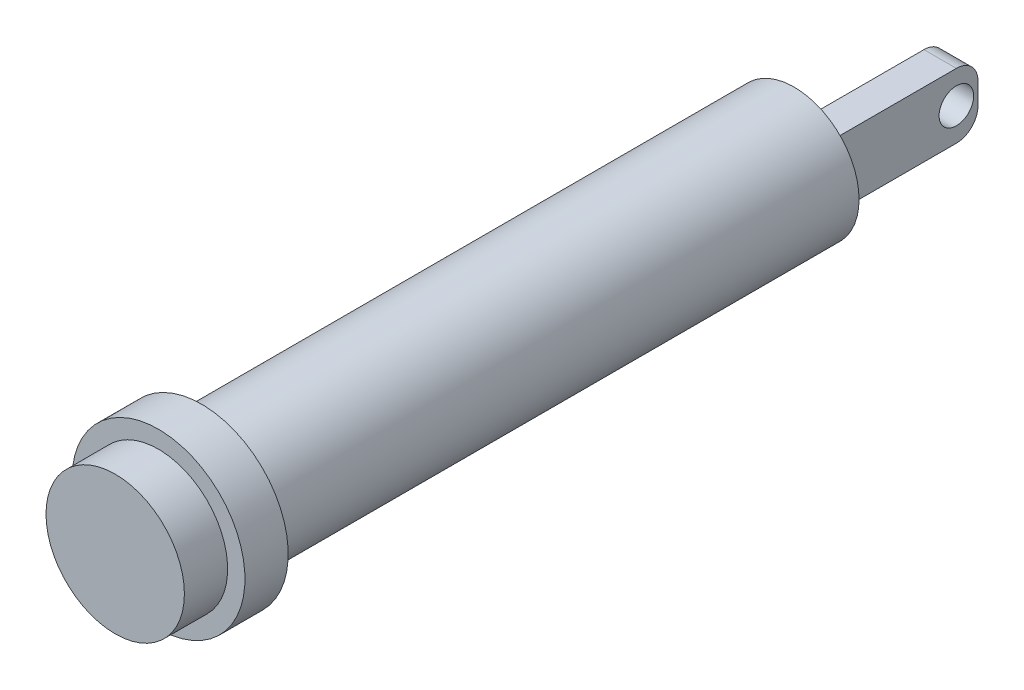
ISO-10303-21;
HEADER;
FILE_DESCRIPTION(('STEP AP214'),'2;1');
FILE_NAME('part.step','',(''),(''),'','','');
FILE_SCHEMA(('AUTOMOTIVE_DESIGN { 1 0 10303 214 1 1 1 1 }'));
ENDSEC;
DATA;
#1=APPLICATION_CONTEXT('core data for automotive mechanical design processes');
#2=APPLICATION_PROTOCOL_DEFINITION('international standard','automotive_design',2000,#1);
#3=PRODUCT_CONTEXT('',#1,'mechanical');
#4=PRODUCT('Part','Part','',(#3));
#5=PRODUCT_RELATED_PRODUCT_CATEGORY('part','',(#4));
#6=PRODUCT_DEFINITION_FORMATION('','',#4);
#7=PRODUCT_DEFINITION_CONTEXT('part definition',#1,'design');
#8=PRODUCT_DEFINITION('design','',#6,#7);
#9=PRODUCT_DEFINITION_SHAPE('','',#8);
#10=(LENGTH_UNIT() NAMED_UNIT(*) SI_UNIT(.MILLI.,.METRE.));
#11=(NAMED_UNIT(*) PLANE_ANGLE_UNIT() SI_UNIT($,.RADIAN.));
#12=(NAMED_UNIT(*) SI_UNIT($,.STERADIAN.) SOLID_ANGLE_UNIT());
#13=UNCERTAINTY_MEASURE_WITH_UNIT(LENGTH_MEASURE(1.E-05),#10,'distance_accuracy_value','');
#14=(GEOMETRIC_REPRESENTATION_CONTEXT(3) GLOBAL_UNCERTAINTY_ASSIGNED_CONTEXT((#13)) GLOBAL_UNIT_ASSIGNED_CONTEXT((#10,
#11,#12)) REPRESENTATION_CONTEXT('',''));
#15=CARTESIAN_POINT('',(0.,0.,0.));
#16=DIRECTION('',(0.,0.,1.));
#17=DIRECTION('',(1.,0.,0.));
#18=AXIS2_PLACEMENT_3D('',#15,#16,#17);
#19=CARTESIAN_POINT('',(0.,0.,-500.));
#20=DIRECTION('',(0.,0.,1.));
#21=DIRECTION('',(1.,0.,0.));
#22=AXIS2_PLACEMENT_3D('',#19,#20,#21);
#23=PLANE('',#22);
#24=DIRECTION('',(1.,0.,0.));
#25=VECTOR('',#24,1.);
#26=CARTESIAN_POINT('',(37.5,37.5000000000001,-500.));
#27=LINE('',#26,#25);
#28=CARTESIAN_POINT('',(0.,37.5000000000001,-500.));
#29=VERTEX_POINT('',#28);
#30=CARTESIAN_POINT('',(37.5,37.5000000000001,-500.));
#31=VERTEX_POINT('',#30);
#32=EDGE_CURVE('E109',#29,#31,#27,.T.);
#33=ORIENTED_EDGE('',*,*,#32,.F.);
#34=DIRECTION('',(0.,-1.,0.));
#35=VECTOR('',#34,1.);
#36=CARTESIAN_POINT('',(0.,37.5000000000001,-500.));
#37=LINE('',#36,#35);
#38=CARTESIAN_POINT('',(0.,-37.4999999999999,-500.));
#39=VERTEX_POINT('',#38);
#40=EDGE_CURVE('E93',#29,#39,#37,.T.);
#41=ORIENTED_EDGE('',*,*,#40,.T.);
#42=DIRECTION('',(-1.,0.,0.));
#43=VECTOR('',#42,1.);
#44=CARTESIAN_POINT('',(37.5,-37.4999999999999,-500.));
#45=LINE('',#44,#43);
#46=CARTESIAN_POINT('',(37.5,-37.4999999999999,-500.));
#47=VERTEX_POINT('',#46);
#48=EDGE_CURVE('E117',#47,#39,#45,.T.);
#49=ORIENTED_EDGE('',*,*,#48,.F.);
#50=DIRECTION('',(0.,-1.,0.));
#51=VECTOR('',#50,1.);
#52=CARTESIAN_POINT('',(37.5,-37.4999999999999,-500.));
#53=LINE('',#52,#51);
#54=EDGE_CURVE('E115',#31,#47,#53,.T.);
#55=ORIENTED_EDGE('',*,*,#54,.F.);
#56=EDGE_LOOP('',(#33,#41,#49,#55));
#57=FACE_BOUND('',#56,.T.);
#58=CARTESIAN_POINT('',(0.,0.,-500.));
#59=DIRECTION('',(0.,0.,1.));
#60=DIRECTION('',(1.,0.,0.));
#61=AXIS2_PLACEMENT_3D('',#58,#59,#60);
#62=CIRCLE('',#61,75.0000000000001);
#63=CARTESIAN_POINT('',(75.0000000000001,0.,-500.));
#64=VERTEX_POINT('',#63);
#65=EDGE_CURVE('E128',#64,#64,#62,.T.);
#66=ORIENTED_EDGE('',*,*,#65,.F.);
#67=EDGE_LOOP('',(#66));
#68=FACE_BOUND('',#67,.T.);
#69=ADVANCED_FACE('F38',(#57,#68),#23,.F.);
#70=CARTESIAN_POINT('',(0.,0.,0.));
#71=DIRECTION('',(0.,0.,1.));
#72=DIRECTION('',(1.,0.,0.));
#73=AXIS2_PLACEMENT_3D('',#70,#71,#72);
#74=CYLINDRICAL_SURFACE('',#73,75.);
#75=CARTESIAN_POINT('',(0.,0.,185.));
#76=DIRECTION('',(0.,0.,-1.));
#77=DIRECTION('',(-1.,0.,0.));
#78=AXIS2_PLACEMENT_3D('',#75,#76,#77);
#79=CIRCLE('',#78,75.);
#80=CARTESIAN_POINT('',(-75.,0.,185.));
#81=VERTEX_POINT('',#80);
#82=EDGE_CURVE('E42',#81,#81,#79,.T.);
#83=ORIENTED_EDGE('',*,*,#82,.T.);
#84=EDGE_LOOP('',(#83));
#85=FACE_BOUND('',#84,.T.);
#86=ORIENTED_EDGE('',*,*,#65,.T.);
#87=EDGE_LOOP('',(#86));
#88=FACE_BOUND('',#87,.T.);
#89=ADVANCED_FACE('F191',(#85,#88),#74,.T.);
#90=CARTESIAN_POINT('',(37.5,37.5000000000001,-675.));
#91=DIRECTION('',(0.,-1.,0.));
#92=DIRECTION('',(0.,0.,-1.));
#93=AXIS2_PLACEMENT_3D('',#90,#91,#92);
#94=PLANE('',#93);
#95=DIRECTION('',(0.,0.,1.));
#96=VECTOR('',#95,1.);
#97=CARTESIAN_POINT('',(37.5,37.5000000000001,-675.));
#98=LINE('',#97,#96);
#99=CARTESIAN_POINT('',(37.5,37.5000000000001,-650.));
#100=VERTEX_POINT('',#99);
#101=EDGE_CURVE('E126',#100,#31,#98,.T.);
#102=ORIENTED_EDGE('',*,*,#101,.F.);
#103=DIRECTION('',(1.,0.,0.));
#104=VECTOR('',#103,1.);
#105=CARTESIAN_POINT('',(37.5,37.5000000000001,-650.));
#106=LINE('',#105,#104);
#107=CARTESIAN_POINT('',(0.,37.5000000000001,-650.));
#108=VERTEX_POINT('',#107);
#109=EDGE_CURVE('E11',#100,#108,#106,.F.);
#110=ORIENTED_EDGE('',*,*,#109,.T.);
#111=DIRECTION('',(0.,0.,-1.));
#112=VECTOR('',#111,1.);
#113=CARTESIAN_POINT('',(0.,37.5000000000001,-500.));
#114=LINE('',#113,#112);
#115=EDGE_CURVE('E97',#29,#108,#114,.T.);
#116=ORIENTED_EDGE('',*,*,#115,.F.);
#117=ORIENTED_EDGE('',*,*,#32,.T.);
#118=EDGE_LOOP('',(#102,#110,#116,#117));
#119=FACE_BOUND('',#118,.T.);
#120=ADVANCED_FACE('F108',(#119),#94,.F.);
#121=CARTESIAN_POINT('',(37.5,-37.4999999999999,-675.));
#122=DIRECTION('',(-1.,0.,0.));
#123=DIRECTION('',(0.,0.,1.));
#124=AXIS2_PLACEMENT_3D('',#121,#122,#123);
#125=PLANE('',#124);
#126=CARTESIAN_POINT('',(37.5,0.,-650.));
#127=DIRECTION('',(1.,0.,0.));
#128=DIRECTION('',(0.,0.,-1.));
#129=AXIS2_PLACEMENT_3D('',#126,#127,#128);
#130=CIRCLE('',#129,20.);
#131=CARTESIAN_POINT('',(37.5,0.,-670.));
#132=VERTEX_POINT('',#131);
#133=EDGE_CURVE('E145',#132,#132,#130,.T.);
#134=ORIENTED_EDGE('',*,*,#133,.F.);
#135=EDGE_LOOP('',(#134));
#136=FACE_BOUND('',#135,.T.);
#137=DIRECTION('',(0.,0.,1.));
#138=VECTOR('',#137,1.);
#139=CARTESIAN_POINT('',(37.5,-37.4999999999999,-675.));
#140=LINE('',#139,#138);
#141=CARTESIAN_POINT('',(37.5,-37.4999999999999,-650.));
#142=VERTEX_POINT('',#141);
#143=EDGE_CURVE('E124',#142,#47,#140,.T.);
#144=ORIENTED_EDGE('',*,*,#143,.F.);
#145=CARTESIAN_POINT('',(37.5,-12.4999999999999,-650.));
#146=DIRECTION('',(-1.,0.,0.));
#147=DIRECTION('',(0.,0.,1.));
#148=AXIS2_PLACEMENT_3D('',#145,#146,#147);
#149=CIRCLE('',#148,25.);
#150=CARTESIAN_POINT('',(37.5,-12.4999999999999,-675.));
#151=VERTEX_POINT('',#150);
#152=EDGE_CURVE('E47',#142,#151,#149,.F.);
#153=ORIENTED_EDGE('',*,*,#152,.T.);
#154=DIRECTION('',(0.,-1.,0.));
#155=VECTOR('',#154,1.);
#156=CARTESIAN_POINT('',(37.5,-37.4999999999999,-675.));
#157=LINE('',#156,#155);
#158=CARTESIAN_POINT('',(37.5,12.5000000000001,-675.));
#159=VERTEX_POINT('',#158);
#160=EDGE_CURVE('E121',#159,#151,#157,.T.);
#161=ORIENTED_EDGE('',*,*,#160,.F.);
#162=CARTESIAN_POINT('',(37.5,12.5000000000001,-650.));
#163=DIRECTION('',(-1.,0.,0.));
#164=DIRECTION('',(0.,0.,1.));
#165=AXIS2_PLACEMENT_3D('',#162,#163,#164);
#166=CIRCLE('',#165,25.);
#167=EDGE_CURVE('E55',#159,#100,#166,.F.);
#168=ORIENTED_EDGE('',*,*,#167,.T.);
#169=ORIENTED_EDGE('',*,*,#101,.T.);
#170=ORIENTED_EDGE('',*,*,#54,.T.);
#171=EDGE_LOOP('',(#144,#153,#161,#168,#169,#170));
#172=FACE_BOUND('',#171,.T.);
#173=ADVANCED_FACE('F212',(#136,#172),#125,.F.);
#174=CARTESIAN_POINT('',(37.5,-37.4999999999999,-675.));
#175=DIRECTION('',(0.,1.,0.));
#176=DIRECTION('',(0.,0.,1.));
#177=AXIS2_PLACEMENT_3D('',#174,#175,#176);
#178=PLANE('',#177);
#179=DIRECTION('',(0.,0.,-1.));
#180=VECTOR('',#179,1.);
#181=CARTESIAN_POINT('',(0.,-37.4999999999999,-500.));
#182=LINE('',#181,#180);
#183=CARTESIAN_POINT('',(0.,-37.4999999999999,-650.));
#184=VERTEX_POINT('',#183);
#185=EDGE_CURVE('E99',#39,#184,#182,.T.);
#186=ORIENTED_EDGE('',*,*,#185,.T.);
#187=DIRECTION('',(-1.,0.,0.));
#188=VECTOR('',#187,1.);
#189=CARTESIAN_POINT('',(37.5,-37.4999999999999,-650.));
#190=LINE('',#189,#188);
#191=EDGE_CURVE('E63',#184,#142,#190,.F.);
#192=ORIENTED_EDGE('',*,*,#191,.T.);
#193=ORIENTED_EDGE('',*,*,#143,.T.);
#194=ORIENTED_EDGE('',*,*,#48,.T.);
#195=EDGE_LOOP('',(#186,#192,#193,#194));
#196=FACE_BOUND('',#195,.T.);
#197=ADVANCED_FACE('F216',(#196),#178,.F.);
#198=CARTESIAN_POINT('',(0.,0.,-675.));
#199=DIRECTION('',(0.,0.,1.));
#200=DIRECTION('',(1.,0.,0.));
#201=AXIS2_PLACEMENT_3D('',#198,#199,#200);
#202=PLANE('',#201);
#203=ORIENTED_EDGE('',*,*,#160,.T.);
#204=DIRECTION('',(-1.,0.,0.));
#205=VECTOR('',#204,1.);
#206=CARTESIAN_POINT('',(0.,-12.4999999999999,-675.));
#207=LINE('',#206,#205);
#208=CARTESIAN_POINT('',(0.,-12.4999999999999,-675.));
#209=VERTEX_POINT('',#208);
#210=EDGE_CURVE('E134',#151,#209,#207,.T.);
#211=ORIENTED_EDGE('',*,*,#210,.T.);
#212=DIRECTION('',(0.,-1.,0.));
#213=VECTOR('',#212,1.);
#214=CARTESIAN_POINT('',(0.,37.5000000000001,-675.));
#215=LINE('',#214,#213);
#216=CARTESIAN_POINT('',(0.,12.5000000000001,-675.));
#217=VERTEX_POINT('',#216);
#218=EDGE_CURVE('E104',#217,#209,#215,.T.);
#219=ORIENTED_EDGE('',*,*,#218,.F.);
#220=DIRECTION('',(1.,0.,0.));
#221=VECTOR('',#220,1.);
#222=CARTESIAN_POINT('',(0.,12.5000000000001,-675.));
#223=LINE('',#222,#221);
#224=EDGE_CURVE('E131',#217,#159,#223,.T.);
#225=ORIENTED_EDGE('',*,*,#224,.T.);
#226=EDGE_LOOP('',(#203,#211,#219,#225));
#227=FACE_BOUND('',#226,.T.);
#228=ADVANCED_FACE('F207',(#227),#202,.F.);
#229=CARTESIAN_POINT('',(0.,37.5000000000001,-500.));
#230=DIRECTION('',(1.,0.,0.));
#231=DIRECTION('',(0.,0.,-1.));
#232=AXIS2_PLACEMENT_3D('',#229,#230,#231);
#233=PLANE('',#232);
#234=CARTESIAN_POINT('',(0.,0.,-650.));
#235=DIRECTION('',(1.,0.,0.));
#236=DIRECTION('',(0.,0.,-1.));
#237=AXIS2_PLACEMENT_3D('',#234,#235,#236);
#238=CIRCLE('',#237,20.);
#239=CARTESIAN_POINT('',(0.,0.,-670.));
#240=VERTEX_POINT('',#239);
#241=EDGE_CURVE('E143',#240,#240,#238,.T.);
#242=ORIENTED_EDGE('',*,*,#241,.T.);
#243=EDGE_LOOP('',(#242));
#244=FACE_BOUND('',#243,.T.);
#245=ORIENTED_EDGE('',*,*,#218,.T.);
#246=CARTESIAN_POINT('',(0.,-12.4999999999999,-650.));
#247=DIRECTION('',(1.,0.,0.));
#248=DIRECTION('',(0.,0.,-1.));
#249=AXIS2_PLACEMENT_3D('',#246,#247,#248);
#250=CIRCLE('',#249,25.);
#251=EDGE_CURVE('E139',#209,#184,#250,.F.);
#252=ORIENTED_EDGE('',*,*,#251,.T.);
#253=ORIENTED_EDGE('',*,*,#185,.F.);
#254=ORIENTED_EDGE('',*,*,#40,.F.);
#255=ORIENTED_EDGE('',*,*,#115,.T.);
#256=CARTESIAN_POINT('',(0.,12.5000000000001,-650.));
#257=DIRECTION('',(1.,0.,0.));
#258=DIRECTION('',(0.,0.,-1.));
#259=AXIS2_PLACEMENT_3D('',#256,#257,#258);
#260=CIRCLE('',#259,25.);
#261=EDGE_CURVE('E137',#108,#217,#260,.F.);
#262=ORIENTED_EDGE('',*,*,#261,.T.);
#263=EDGE_LOOP('',(#245,#252,#253,#254,#255,#262));
#264=FACE_BOUND('',#263,.T.);
#265=ADVANCED_FACE('F96',(#244,#264),#233,.F.);
#266=CARTESIAN_POINT('',(0.,-12.4999999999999,-650.));
#267=DIRECTION('',(-1.,0.,0.));
#268=DIRECTION('',(0.,0.,1.));
#269=AXIS2_PLACEMENT_3D('',#266,#267,#268);
#270=CYLINDRICAL_SURFACE('',#269,25.);
#271=ORIENTED_EDGE('',*,*,#152,.F.);
#272=ORIENTED_EDGE('',*,*,#191,.F.);
#273=ORIENTED_EDGE('',*,*,#251,.F.);
#274=ORIENTED_EDGE('',*,*,#210,.F.);
#275=EDGE_LOOP('',(#271,#272,#273,#274));
#276=FACE_BOUND('',#275,.T.);
#277=ADVANCED_FACE('F199',(#276),#270,.T.);
#278=CARTESIAN_POINT('',(0.,12.5000000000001,-650.));
#279=DIRECTION('',(1.,0.,0.));
#280=DIRECTION('',(0.,0.,-1.));
#281=AXIS2_PLACEMENT_3D('',#278,#279,#280);
#282=CYLINDRICAL_SURFACE('',#281,25.);
#283=ORIENTED_EDGE('',*,*,#261,.F.);
#284=ORIENTED_EDGE('',*,*,#109,.F.);
#285=ORIENTED_EDGE('',*,*,#167,.F.);
#286=ORIENTED_EDGE('',*,*,#224,.F.);
#287=EDGE_LOOP('',(#283,#284,#285,#286));
#288=FACE_BOUND('',#287,.T.);
#289=ADVANCED_FACE('F40',(#288),#282,.T.);
#290=CARTESIAN_POINT('',(-112.5,0.,-650.));
#291=DIRECTION('',(1.,0.,0.));
#292=DIRECTION('',(0.,0.,-1.));
#293=AXIS2_PLACEMENT_3D('',#290,#291,#292);
#294=CYLINDRICAL_SURFACE('',#293,20.);
#295=ORIENTED_EDGE('',*,*,#133,.T.);
#296=EDGE_LOOP('',(#295));
#297=FACE_BOUND('',#296,.T.);
#298=ORIENTED_EDGE('',*,*,#241,.F.);
#299=EDGE_LOOP('',(#298));
#300=FACE_BOUND('',#299,.T.);
#301=ADVANCED_FACE('F172',(#297,#300),#294,.F.);
#302=CARTESIAN_POINT('',(0.,0.,185.));
#303=DIRECTION('',(0.,0.,1.));
#304=DIRECTION('',(1.,0.,0.));
#305=AXIS2_PLACEMENT_3D('',#302,#303,#304);
#306=CYLINDRICAL_SURFACE('',#305,100.);
#307=CARTESIAN_POINT('',(0.,0.,185.));
#308=DIRECTION('',(0.,0.,-1.));
#309=DIRECTION('',(-1.,0.,0.));
#310=AXIS2_PLACEMENT_3D('',#307,#308,#309);
#311=CIRCLE('',#310,100.);
#312=CARTESIAN_POINT('',(-100.,0.,185.));
#313=VERTEX_POINT('',#312);
#314=EDGE_CURVE('E160',#313,#313,#311,.T.);
#315=ORIENTED_EDGE('',*,*,#314,.F.);
#316=EDGE_LOOP('',(#315));
#317=FACE_BOUND('',#316,.T.);
#318=CARTESIAN_POINT('',(0.,0.,235.));
#319=DIRECTION('',(0.,0.,-1.));
#320=DIRECTION('',(-1.,0.,0.));
#321=AXIS2_PLACEMENT_3D('',#318,#319,#320);
#322=CIRCLE('',#321,100.);
#323=CARTESIAN_POINT('',(-100.,0.,235.));
#324=VERTEX_POINT('',#323);
#325=EDGE_CURVE('E161',#324,#324,#322,.T.);
#326=ORIENTED_EDGE('',*,*,#325,.T.);
#327=EDGE_LOOP('',(#326));
#328=FACE_BOUND('',#327,.T.);
#329=ADVANCED_FACE('F169',(#317,#328),#306,.T.);
#330=CARTESIAN_POINT('',(0.,0.,185.));
#331=DIRECTION('',(0.,0.,-1.));
#332=DIRECTION('',(-1.,0.,0.));
#333=AXIS2_PLACEMENT_3D('',#330,#331,#332);
#334=PLANE('',#333);
#335=ORIENTED_EDGE('',*,*,#82,.F.);
#336=EDGE_LOOP('',(#335));
#337=FACE_BOUND('',#336,.T.);
#338=ORIENTED_EDGE('',*,*,#314,.T.);
#339=EDGE_LOOP('',(#338));
#340=FACE_BOUND('',#339,.T.);
#341=ADVANCED_FACE('F167',(#337,#340),#334,.T.);
#342=CARTESIAN_POINT('',(0.,0.,235.));
#343=DIRECTION('',(0.,0.,-1.));
#344=DIRECTION('',(-1.,0.,0.));
#345=AXIS2_PLACEMENT_3D('',#342,#343,#344);
#346=PLANE('',#345);
#347=CARTESIAN_POINT('',(0.,0.,235.));
#348=DIRECTION('',(0.,0.,-1.));
#349=DIRECTION('',(-1.,0.,0.));
#350=AXIS2_PLACEMENT_3D('',#347,#348,#349);
#351=CIRCLE('',#350,80.);
#352=CARTESIAN_POINT('',(-80.,0.,235.));
#353=VERTEX_POINT('',#352);
#354=EDGE_CURVE('E157',#353,#353,#351,.T.);
#355=ORIENTED_EDGE('',*,*,#354,.T.);
#356=EDGE_LOOP('',(#355));
#357=FACE_BOUND('',#356,.T.);
#358=ORIENTED_EDGE('',*,*,#325,.F.);
#359=EDGE_LOOP('',(#358));
#360=FACE_BOUND('',#359,.T.);
#361=ADVANCED_FACE('F176',(#357,#360),#346,.F.);
#362=CARTESIAN_POINT('',(0.,0.,285.));
#363=DIRECTION('',(0.,0.,1.));
#364=DIRECTION('',(1.,0.,0.));
#365=AXIS2_PLACEMENT_3D('',#362,#363,#364);
#366=PLANE('',#365);
#367=CARTESIAN_POINT('',(0.,0.,285.));
#368=DIRECTION('',(0.,0.,1.));
#369=DIRECTION('',(1.,0.,0.));
#370=AXIS2_PLACEMENT_3D('',#367,#368,#369);
#371=CIRCLE('',#370,80.);
#372=CARTESIAN_POINT('',(80.,0.,285.));
#373=VERTEX_POINT('',#372);
#374=EDGE_CURVE('E150',#373,#373,#371,.T.);
#375=ORIENTED_EDGE('',*,*,#374,.T.);
#376=EDGE_LOOP('',(#375));
#377=FACE_BOUND('',#376,.T.);
#378=ADVANCED_FACE('F178',(#377),#366,.T.);
#379=CARTESIAN_POINT('',(0.,0.,285.));
#380=DIRECTION('',(0.,0.,-1.));
#381=DIRECTION('',(-1.,0.,0.));
#382=AXIS2_PLACEMENT_3D('',#379,#380,#381);
#383=CYLINDRICAL_SURFACE('',#382,80.);
#384=ORIENTED_EDGE('',*,*,#374,.F.);
#385=EDGE_LOOP('',(#384));
#386=FACE_BOUND('',#385,.T.);
#387=ORIENTED_EDGE('',*,*,#354,.F.);
#388=EDGE_LOOP('',(#387));
#389=FACE_BOUND('',#388,.T.);
#390=ADVANCED_FACE('F185',(#386,#389),#383,.T.);
#391=CLOSED_SHELL('',(#69,#89,#120,#173,#197,#228,#265,#277,#289,#301,#329,#341,#361,#378,#390));
#392=MANIFOLD_SOLID_BREP('B2',#391);
#393=ADVANCED_BREP_SHAPE_REPRESENTATION('',(#18,#392),#14);
#394=SHAPE_DEFINITION_REPRESENTATION(#9,#393);
ENDSEC;
END-ISO-10303-21;
